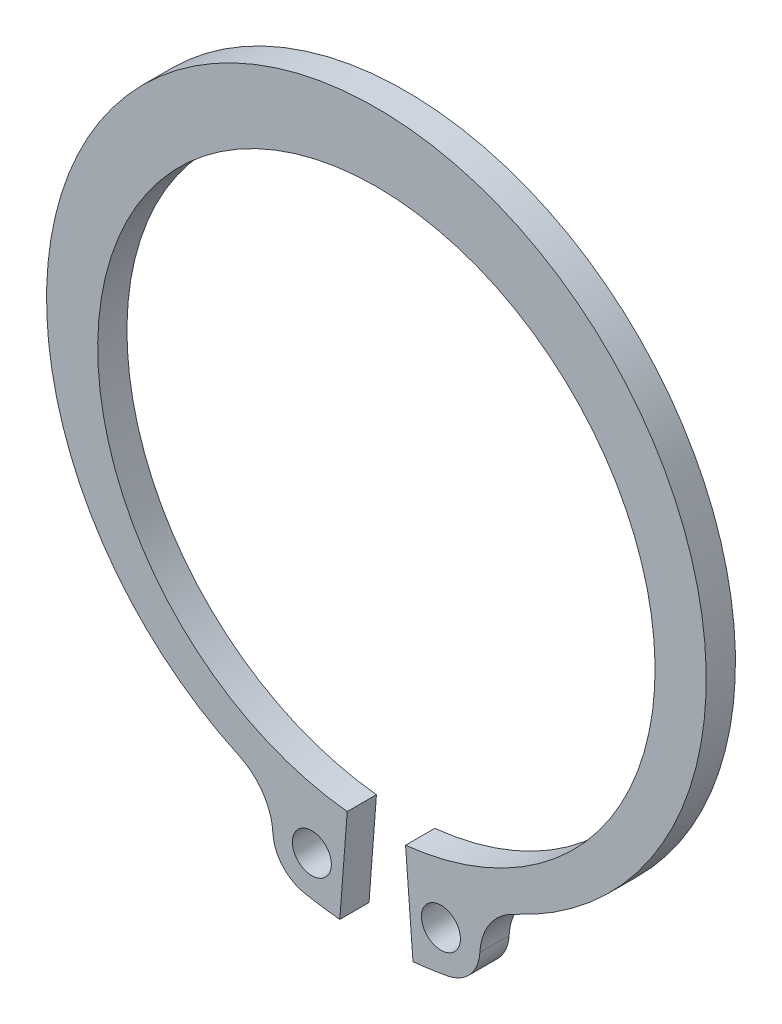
from build123d import *

# Parameters (mm, degrees)
ESQUISSE1_R          = 1
BASE_EXTRUSION_DEPTH = 1.5


with BuildPart() as part:
    # Esquisse1 → Base-Extrusion (new body)
    with BuildSketch(Plane.XY):
        with BuildLine():
            Line((1.496865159, -14.221441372), (1.877447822, -19.206936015))
            ThreePointArc((1.877447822, -19.206936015), (2.789337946, -19.095831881), (3.69490774, -18.941458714))
            ThreePointArc((3.69490774, -18.941458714), (4.822315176, -18.289528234), (5.309319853, -17.081684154))
            ThreePointArc((5.309319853, -17.081684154), (5.822961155, -15.551919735), (7.054833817, -14.509568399))
            ThreePointArc((7.054833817, -14.509568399), (0, 17.8), (-7.054833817, -14.509568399))
            ThreePointArc((-7.054833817, -14.509568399), (-5.822961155, -15.551919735), (-5.309319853, -17.081684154))
            ThreePointArc((-5.309319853, -17.081684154), (-4.822315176, -18.289528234), (-3.69490774, -18.941458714))
            ThreePointArc((-3.69490774, -18.941458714), (-2.789337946, -19.095831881), (-1.877447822, -19.206936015))
            Line((-1.877447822, -19.206936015), (-1.496865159, -14.221441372))
            ThreePointArc((-1.496865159, -14.221441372), (0, 14.3), (1.496865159, -14.221441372))
        make_face()
        with Locations((3.311985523, -16.978458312)):
            Circle(ESQUISSE1_R, mode=Mode.SUBTRACT)
        with Locations(Location((-3.311985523, -16.978458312, 0), (0, 0, 180))):
            Circle(ESQUISSE1_R, mode=Mode.SUBTRACT)
    extrude(amount=BASE_EXTRUSION_DEPTH)


solid = part.part
